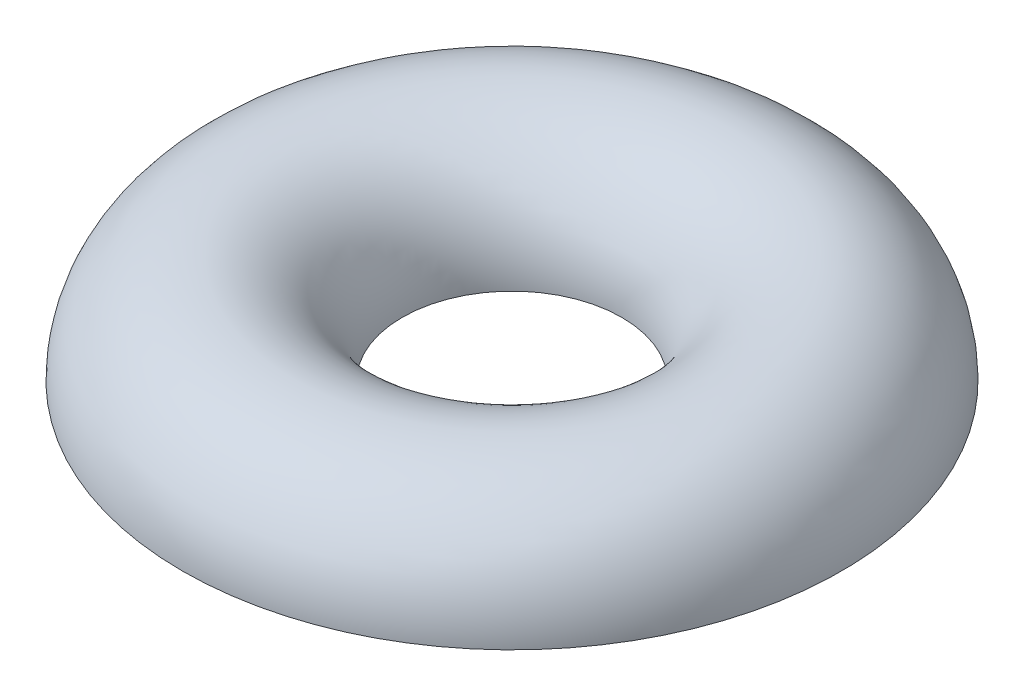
ISO-10303-21;
HEADER;
FILE_DESCRIPTION(('STEP AP214'),'2;1');
FILE_NAME('part.step','',(''),(''),'','','');
FILE_SCHEMA(('AUTOMOTIVE_DESIGN { 1 0 10303 214 1 1 1 1 }'));
ENDSEC;
DATA;
#1=APPLICATION_CONTEXT('core data for automotive mechanical design processes');
#2=APPLICATION_PROTOCOL_DEFINITION('international standard','automotive_design',2000,#1);
#3=PRODUCT_CONTEXT('',#1,'mechanical');
#4=PRODUCT('Part','Part','',(#3));
#5=PRODUCT_RELATED_PRODUCT_CATEGORY('part','',(#4));
#6=PRODUCT_DEFINITION_FORMATION('','',#4);
#7=PRODUCT_DEFINITION_CONTEXT('part definition',#1,'design');
#8=PRODUCT_DEFINITION('design','',#6,#7);
#9=PRODUCT_DEFINITION_SHAPE('','',#8);
#10=(LENGTH_UNIT() NAMED_UNIT(*) SI_UNIT(.MILLI.,.METRE.));
#11=(NAMED_UNIT(*) PLANE_ANGLE_UNIT() SI_UNIT($,.RADIAN.));
#12=(NAMED_UNIT(*) SI_UNIT($,.STERADIAN.) SOLID_ANGLE_UNIT());
#13=UNCERTAINTY_MEASURE_WITH_UNIT(LENGTH_MEASURE(1.E-05),#10,'distance_accuracy_value','');
#14=(GEOMETRIC_REPRESENTATION_CONTEXT(3) GLOBAL_UNCERTAINTY_ASSIGNED_CONTEXT((#13)) GLOBAL_UNIT_ASSIGNED_CONTEXT((#10,
#11,#12)) REPRESENTATION_CONTEXT('',''));
#15=CARTESIAN_POINT('',(0.,0.,0.));
#16=DIRECTION('',(0.,0.,1.));
#17=DIRECTION('',(1.,0.,0.));
#18=AXIS2_PLACEMENT_3D('',#15,#16,#17);
#19=CARTESIAN_POINT('',(0.,0.,0.));
#20=DIRECTION('',(0.,1.,0.));
#21=DIRECTION('',(0.,0.,1.));
#22=AXIS2_PLACEMENT_3D('',#19,#20,#21);
#23=TOROIDAL_SURFACE('',#22,50.8,25.4);
#24=CARTESIAN_POINT('',(0.,0.,0.));
#25=DIRECTION('',(0.,1.,0.));
#26=DIRECTION('',(0.,0.,1.));
#27=AXIS2_PLACEMENT_3D('',#24,#25,#26);
#28=CIRCLE('',#27,76.2);
#29=CARTESIAN_POINT('',(0.,0.,76.2));
#30=VERTEX_POINT('',#29);
#31=EDGE_CURVE('E10',#30,#30,#28,.T.);
#32=ORIENTED_EDGE('',*,*,#31,.T.);
#33=EDGE_LOOP('',(#32));
#34=FACE_BOUND('',#33,.T.);
#35=CARTESIAN_POINT('',(0.,0.,0.));
#36=DIRECTION('',(0.,-1.,0.));
#37=DIRECTION('',(0.,0.,-1.));
#38=AXIS2_PLACEMENT_3D('',#35,#36,#37);
#39=CIRCLE('',#38,25.4);
#40=CARTESIAN_POINT('',(0.,0.,-25.4));
#41=VERTEX_POINT('',#40);
#42=EDGE_CURVE('E40',#41,#41,#39,.T.);
#43=ORIENTED_EDGE('',*,*,#42,.T.);
#44=EDGE_LOOP('',(#43));
#45=FACE_BOUND('',#44,.T.);
#46=ADVANCED_FACE('F34',(#34,#45),#23,.T.);
#47=CARTESIAN_POINT('',(79.2552366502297,0.,-76.2));
#48=DIRECTION('',(0.,1.,0.));
#49=DIRECTION('',(0.,0.,1.));
#50=AXIS2_PLACEMENT_3D('',#47,#48,#49);
#51=PLANE('',#50);
#52=ORIENTED_EDGE('',*,*,#42,.F.);
#53=EDGE_LOOP('',(#52));
#54=FACE_BOUND('',#53,.T.);
#55=ORIENTED_EDGE('',*,*,#31,.F.);
#56=EDGE_LOOP('',(#55));
#57=FACE_BOUND('',#56,.T.);
#58=ADVANCED_FACE('F47',(#54,#57),#51,.F.);
#59=CLOSED_SHELL('',(#46,#58));
#60=MANIFOLD_SOLID_BREP('B2',#59);
#61=ADVANCED_BREP_SHAPE_REPRESENTATION('',(#18,#60),#14);
#62=SHAPE_DEFINITION_REPRESENTATION(#9,#61);
ENDSEC;
END-ISO-10303-21;
